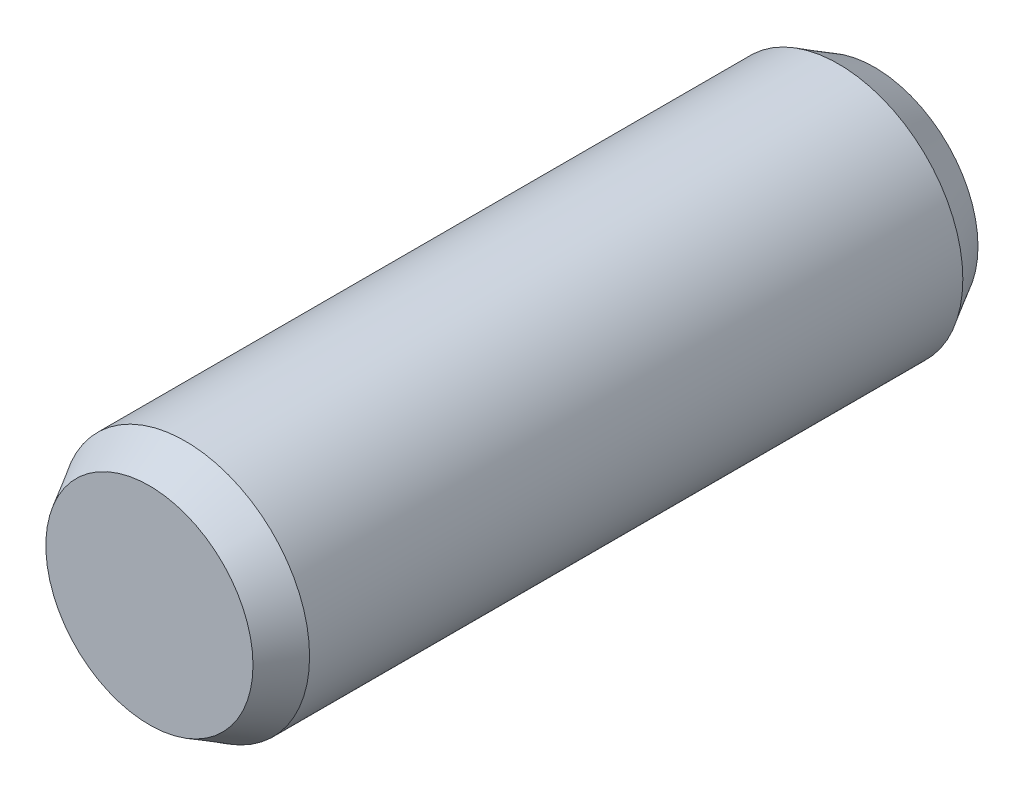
from build123d import *

# Parameters (mm, degrees)
ESQUISSE1_R      = 6
EXTRUSION1_DEPTH = 17.5
CHANFREIN1_SIZE  = 1
CHANFREIN1_SIZE2 = 1.732050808
CHANFREIN2_SIZE  = 1
CHANFREIN2_SIZE2 = 1.732050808


with BuildPart() as part:
    # Esquisse1 → Extrusion1 (new, symmetric)
    with BuildSketch(Plane.XY):
        Circle(ESQUISSE1_R)
    extrude(amount=EXTRUSION1_DEPTH, both=True)

    # Chanfrein1
    chanfrein1_edges = [part.edges().sort_by_distance(p)[0] for p in [
        (-6, 0, -17.5),
    ]]
    chanfrein1_side = [part.faces().sort_by_distance(p)[0] for p in [
        (0, 0, -17.5),
    ]]
    chamfer(chanfrein1_edges, length=CHANFREIN1_SIZE, length2=CHANFREIN1_SIZE2, reference=chanfrein1_side[0])

    # Chanfrein2
    chanfrein2_edges = [part.edges().sort_by_distance(p)[0] for p in [
        (-6, 0, 17.5),
    ]]
    chanfrein2_side = [part.faces().sort_by_distance(p)[0] for p in [
        (0, 0, 17.5),
    ]]
    chamfer(chanfrein2_edges, length=CHANFREIN2_SIZE, length2=CHANFREIN2_SIZE2, reference=chanfrein2_side[0])


solid = part.part
